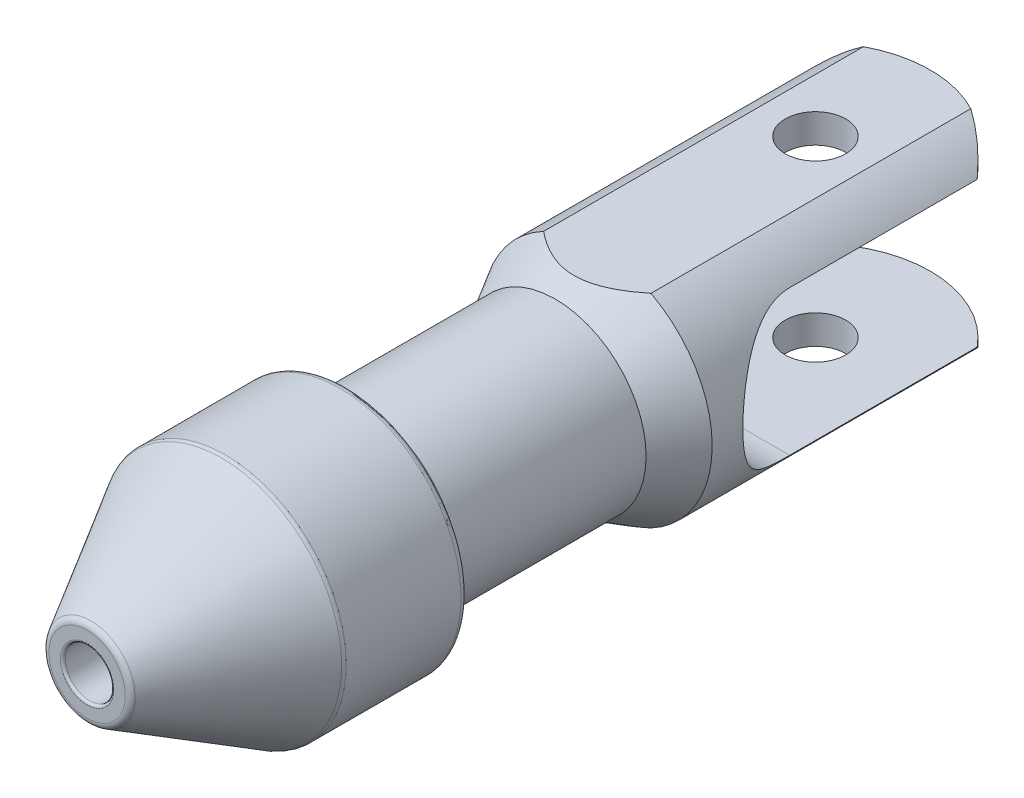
ISO-10303-21;
HEADER;
FILE_DESCRIPTION(('STEP AP214'),'2;1');
FILE_NAME('part.step','',(''),(''),'','','');
FILE_SCHEMA(('AUTOMOTIVE_DESIGN { 1 0 10303 214 1 1 1 1 }'));
ENDSEC;
DATA;
#1=APPLICATION_CONTEXT('core data for automotive mechanical design processes');
#2=APPLICATION_PROTOCOL_DEFINITION('international standard','automotive_design',2000,#1);
#3=PRODUCT_CONTEXT('',#1,'mechanical');
#4=PRODUCT('Part','Part','',(#3));
#5=PRODUCT_RELATED_PRODUCT_CATEGORY('part','',(#4));
#6=PRODUCT_DEFINITION_FORMATION('','',#4);
#7=PRODUCT_DEFINITION_CONTEXT('part definition',#1,'design');
#8=PRODUCT_DEFINITION('design','',#6,#7);
#9=PRODUCT_DEFINITION_SHAPE('','',#8);
#10=(LENGTH_UNIT() NAMED_UNIT(*) SI_UNIT(.MILLI.,.METRE.));
#11=(NAMED_UNIT(*) PLANE_ANGLE_UNIT() SI_UNIT($,.RADIAN.));
#12=(NAMED_UNIT(*) SI_UNIT($,.STERADIAN.) SOLID_ANGLE_UNIT());
#13=UNCERTAINTY_MEASURE_WITH_UNIT(LENGTH_MEASURE(1.E-05),#10,'distance_accuracy_value','');
#14=(GEOMETRIC_REPRESENTATION_CONTEXT(3) GLOBAL_UNCERTAINTY_ASSIGNED_CONTEXT((#13)) GLOBAL_UNIT_ASSIGNED_CONTEXT((#10,
#11,#12)) REPRESENTATION_CONTEXT('',''));
#15=CARTESIAN_POINT('',(0.,0.,0.));
#16=DIRECTION('',(0.,0.,1.));
#17=DIRECTION('',(1.,0.,0.));
#18=AXIS2_PLACEMENT_3D('',#15,#16,#17);
#19=CARTESIAN_POINT('',(0.,-27.75,53.7618675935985));
#20=DIRECTION('',(0.,0.,1.));
#21=DIRECTION('',(0.,-1.,0.));
#22=AXIS2_PLACEMENT_3D('',#19,#20,#21);
#23=PLANE('',#22);
#24=CARTESIAN_POINT('',(0.,0.,53.7618675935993));
#25=DIRECTION('',(0.,0.,-1.));
#26=DIRECTION('',(-1.,0.,0.));
#27=AXIS2_PLACEMENT_3D('',#24,#25,#26);
#28=CIRCLE('',#27,16.7480854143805);
#29=CARTESIAN_POINT('',(-16.7480854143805,0.,53.7618675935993));
#30=VERTEX_POINT('',#29);
#31=EDGE_CURVE('E19',#30,#30,#28,.F.);
#32=ORIENTED_EDGE('',*,*,#31,.T.);
#33=EDGE_LOOP('',(#32));
#34=FACE_BOUND('',#33,.T.);
#35=CARTESIAN_POINT('',(0.,0.,53.7618675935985));
#36=DIRECTION('',(0.,0.,-1.));
#37=DIRECTION('',(0.,1.,0.));
#38=AXIS2_PLACEMENT_3D('',#35,#36,#37);
#39=CIRCLE('',#38,27.75);
#40=CARTESIAN_POINT('',(0.,27.75,53.7618675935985));
#41=VERTEX_POINT('',#40);
#42=EDGE_CURVE('E240',#41,#41,#39,.T.);
#43=ORIENTED_EDGE('',*,*,#42,.T.);
#44=EDGE_LOOP('',(#43));
#45=FACE_BOUND('',#44,.T.);
#46=ADVANCED_FACE('F16',(#34,#45),#23,.F.);
#47=CARTESIAN_POINT('',(0.,0.,53.7618675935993));
#48=DIRECTION('',(0.,0.,-1.));
#49=DIRECTION('',(-1.,0.,0.));
#50=AXIS2_PLACEMENT_3D('',#47,#48,#49);
#51=CONICAL_SURFACE('',#50,16.7480854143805,0.0750491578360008);
#52=CARTESIAN_POINT('',(0.,0.,143.508529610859));
#53=DIRECTION('',(0.,0.,-1.));
#54=DIRECTION('',(0.,1.,0.));
#55=AXIS2_PLACEMENT_3D('',#52,#53,#54);
#56=CIRCLE('',#55,10.);
#57=CARTESIAN_POINT('',(0.,9.99999999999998,143.508529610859));
#58=VERTEX_POINT('',#57);
#59=EDGE_CURVE('E235',#58,#58,#56,.F.);
#60=ORIENTED_EDGE('',*,*,#59,.T.);
#61=EDGE_LOOP('',(#60));
#62=FACE_BOUND('',#61,.T.);
#63=ORIENTED_EDGE('',*,*,#31,.F.);
#64=EDGE_LOOP('',(#63));
#65=FACE_BOUND('',#64,.T.);
#66=ADVANCED_FACE('F425',(#62,#65),#51,.F.);
#67=CARTESIAN_POINT('',(0.,0.,47.7618675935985));
#68=DIRECTION('',(0.,0.,-1.));
#69=DIRECTION('',(0.,1.,0.));
#70=AXIS2_PLACEMENT_3D('',#67,#68,#69);
#71=CYLINDRICAL_SURFACE('',#70,27.75);
#72=ORIENTED_EDGE('',*,*,#42,.F.);
#73=EDGE_LOOP('',(#72));
#74=FACE_BOUND('',#73,.T.);
#75=CARTESIAN_POINT('',(0.,0.,41.7618675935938));
#76=DIRECTION('',(0.,0.,1.));
#77=DIRECTION('',(0.,-1.,0.));
#78=AXIS2_PLACEMENT_3D('',#75,#76,#77);
#79=CIRCLE('',#78,27.7500000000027);
#80=CARTESIAN_POINT('',(0.,-27.7500000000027,41.7618675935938));
#81=VERTEX_POINT('',#80);
#82=EDGE_CURVE('E227',#81,#81,#79,.F.);
#83=ORIENTED_EDGE('',*,*,#82,.T.);
#84=EDGE_LOOP('',(#83));
#85=FACE_BOUND('',#84,.T.);
#86=ADVANCED_FACE('F427',(#74,#85),#71,.F.);
#87=CARTESIAN_POINT('',(0.,0.,156.008529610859));
#88=DIRECTION('',(0.,0.,-1.));
#89=DIRECTION('',(0.,1.,0.));
#90=AXIS2_PLACEMENT_3D('',#87,#88,#89);
#91=CYLINDRICAL_SURFACE('',#90,10.);
#92=CARTESIAN_POINT('',(0.,0.,167.508529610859));
#93=DIRECTION('',(0.,0.,-1.));
#94=DIRECTION('',(-1.,0.,0.));
#95=AXIS2_PLACEMENT_3D('',#92,#93,#94);
#96=CIRCLE('',#95,10.);
#97=CARTESIAN_POINT('',(-10.,0.,167.508529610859));
#98=VERTEX_POINT('',#97);
#99=EDGE_CURVE('E208',#98,#98,#96,.T.);
#100=ORIENTED_EDGE('',*,*,#99,.F.);
#101=EDGE_LOOP('',(#100));
#102=FACE_BOUND('',#101,.T.);
#103=ORIENTED_EDGE('',*,*,#59,.F.);
#104=EDGE_LOOP('',(#103));
#105=FACE_BOUND('',#104,.T.);
#106=ADVANCED_FACE('F434',(#102,#105),#91,.F.);
#107=CARTESIAN_POINT('',(0.,0.,41.7618675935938));
#108=DIRECTION('',(0.,0.,1.));
#109=DIRECTION('',(1.,0.,0.));
#110=AXIS2_PLACEMENT_3D('',#107,#108,#109);
#111=CONICAL_SURFACE('',#110,27.7500000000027,1.0471975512);
#112=ORIENTED_EDGE('',*,*,#82,.F.);
#113=EDGE_LOOP('',(#112));
#114=FACE_BOUND('',#113,.T.);
#115=CARTESIAN_POINT('',(0.,0.,40.6799131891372));
#116=DIRECTION('',(0.,0.,1.));
#117=DIRECTION('',(1.,0.,0.));
#118=AXIS2_PLACEMENT_3D('',#115,#116,#117);
#119=CIRCLE('',#118,25.876);
#120=CARTESIAN_POINT('',(25.876,0.,40.6799131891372));
#121=VERTEX_POINT('',#120);
#122=EDGE_CURVE('E200',#121,#121,#119,.F.);
#123=ORIENTED_EDGE('',*,*,#122,.T.);
#124=EDGE_LOOP('',(#123));
#125=FACE_BOUND('',#124,.T.);
#126=ADVANCED_FACE('F218',(#114,#125),#111,.F.);
#127=CARTESIAN_POINT('',(0.,0.,167.508529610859));
#128=DIRECTION('',(0.,0.,-1.));
#129=DIRECTION('',(-1.,0.,0.));
#130=AXIS2_PLACEMENT_3D('',#127,#128,#129);
#131=TOROIDAL_SURFACE('',#130,11.,1.);
#132=CARTESIAN_POINT('',(0.,0.,168.508529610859));
#133=DIRECTION('',(0.,0.,1.));
#134=DIRECTION('',(0.,-1.,0.));
#135=AXIS2_PLACEMENT_3D('',#132,#133,#134);
#136=CIRCLE('',#135,11.);
#137=CARTESIAN_POINT('',(0.,-11.,168.508529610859));
#138=VERTEX_POINT('',#137);
#139=EDGE_CURVE('E163',#138,#138,#136,.F.);
#140=ORIENTED_EDGE('',*,*,#139,.F.);
#141=EDGE_LOOP('',(#140));
#142=FACE_BOUND('',#141,.T.);
#143=ORIENTED_EDGE('',*,*,#99,.T.);
#144=EDGE_LOOP('',(#143));
#145=FACE_BOUND('',#144,.T.);
#146=ADVANCED_FACE('F214',(#142,#145),#131,.T.);
#147=CARTESIAN_POINT('',(0.,0.,22.5));
#148=DIRECTION('',(0.,0.,1.));
#149=DIRECTION('',(1.,0.,0.));
#150=AXIS2_PLACEMENT_3D('',#147,#148,#149);
#151=CYLINDRICAL_SURFACE('',#150,25.876);
#152=CARTESIAN_POINT('',(0.,0.,13.6568778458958));
#153=DIRECTION('',(0.,0.,-1.));
#154=DIRECTION('',(0.,-1.,0.));
#155=AXIS2_PLACEMENT_3D('',#152,#153,#154);
#156=CIRCLE('',#155,25.8759999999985);
#157=CARTESIAN_POINT('',(0.,-25.8759999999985,13.6568778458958));
#158=VERTEX_POINT('',#157);
#159=EDGE_CURVE('E159',#158,#158,#156,.T.);
#160=ORIENTED_EDGE('',*,*,#159,.T.);
#161=EDGE_LOOP('',(#160));
#162=FACE_BOUND('',#161,.T.);
#163=ORIENTED_EDGE('',*,*,#122,.F.);
#164=EDGE_LOOP('',(#163));
#165=FACE_BOUND('',#164,.T.);
#166=ADVANCED_FACE('F184',(#162,#165),#151,.F.);
#167=CARTESIAN_POINT('',(0.,17.5,168.508529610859));
#168=DIRECTION('',(0.,0.,1.));
#169=DIRECTION('',(0.,-1.,0.));
#170=AXIS2_PLACEMENT_3D('',#167,#168,#169);
#171=PLANE('',#170);
#172=ORIENTED_EDGE('',*,*,#139,.T.);
#173=EDGE_LOOP('',(#172));
#174=FACE_BOUND('',#173,.T.);
#175=CARTESIAN_POINT('',(0.,0.,168.508529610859));
#176=DIRECTION('',(0.,0.,-1.));
#177=DIRECTION('',(0.,1.,0.));
#178=AXIS2_PLACEMENT_3D('',#175,#176,#177);
#179=CIRCLE('',#178,15.7679491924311);
#180=CARTESIAN_POINT('',(0.,15.7679491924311,168.508529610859));
#181=VERTEX_POINT('',#180);
#182=EDGE_CURVE('E162',#181,#181,#179,.T.);
#183=ORIENTED_EDGE('',*,*,#182,.F.);
#184=EDGE_LOOP('',(#183));
#185=FACE_BOUND('',#184,.T.);
#186=ADVANCED_FACE('F175',(#174,#185),#171,.T.);
#187=CARTESIAN_POINT('',(0.,0.,10.4110146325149));
#188=DIRECTION('',(0.,0.,-1.));
#189=DIRECTION('',(0.,1.,0.));
#190=AXIS2_PLACEMENT_3D('',#187,#188,#189);
#191=CONICAL_SURFACE('',#190,27.7500000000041,0.5235987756);
#192=CARTESIAN_POINT('',(0.,0.,10.4110146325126));
#193=DIRECTION('',(0.,0.,-1.));
#194=DIRECTION('',(0.,1.,0.));
#195=AXIS2_PLACEMENT_3D('',#192,#193,#194);
#196=CIRCLE('',#195,27.75);
#197=CARTESIAN_POINT('',(0.,27.75,10.4110146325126));
#198=VERTEX_POINT('',#197);
#199=EDGE_CURVE('E777',#198,#198,#196,.T.);
#200=ORIENTED_EDGE('',*,*,#199,.T.);
#201=EDGE_LOOP('',(#200));
#202=FACE_BOUND('',#201,.T.);
#203=ORIENTED_EDGE('',*,*,#159,.F.);
#204=EDGE_LOOP('',(#203));
#205=FACE_BOUND('',#204,.T.);
#206=ADVANCED_FACE('F150',(#202,#205),#191,.F.);
#207=CARTESIAN_POINT('',(0.,0.,165.508529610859));
#208=DIRECTION('',(0.,0.,-1.));
#209=DIRECTION('',(-1.,0.,0.));
#210=AXIS2_PLACEMENT_3D('',#207,#208,#209);
#211=TOROIDAL_SURFACE('',#210,15.7679491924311,3.);
#212=CARTESIAN_POINT('',(0.,0.,167.008529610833));
#213=DIRECTION('',(0.,0.,-1.));
#214=DIRECTION('',(0.,1.,0.));
#215=AXIS2_PLACEMENT_3D('',#212,#213,#214);
#216=CIRCLE('',#215,18.3660254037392);
#217=CARTESIAN_POINT('',(0.,18.3660254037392,167.008529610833));
#218=VERTEX_POINT('',#217);
#219=EDGE_CURVE('E417',#218,#218,#216,.T.);
#220=ORIENTED_EDGE('',*,*,#219,.F.);
#221=EDGE_LOOP('',(#220));
#222=FACE_BOUND('',#221,.T.);
#223=ORIENTED_EDGE('',*,*,#182,.T.);
#224=EDGE_LOOP('',(#223));
#225=FACE_BOUND('',#224,.T.);
#226=ADVANCED_FACE('F144',(#222,#225),#211,.T.);
#227=CARTESIAN_POINT('',(0.,0.,-22.987907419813));
#228=DIRECTION('',(0.,0.,-1.));
#229=DIRECTION('',(0.,1.,0.));
#230=AXIS2_PLACEMENT_3D('',#227,#228,#229);
#231=CYLINDRICAL_SURFACE('',#230,27.75);
#232=ORIENTED_EDGE('',*,*,#199,.F.);
#233=EDGE_LOOP('',(#232));
#234=FACE_BOUND('',#233,.T.);
#235=CARTESIAN_POINT('',(0.,0.,-55.));
#236=DIRECTION('',(0.,0.,-1.));
#237=DIRECTION('',(0.,1.,0.));
#238=AXIS2_PLACEMENT_3D('',#235,#236,#237);
#239=CIRCLE('',#238,27.75);
#240=CARTESIAN_POINT('',(0.,27.75,-55.));
#241=VERTEX_POINT('',#240);
#242=EDGE_CURVE('E415',#241,#241,#239,.T.);
#243=ORIENTED_EDGE('',*,*,#242,.T.);
#244=EDGE_LOOP('',(#243));
#245=FACE_BOUND('',#244,.T.);
#246=ADVANCED_FACE('F140',(#234,#245),#231,.F.);
#247=CARTESIAN_POINT('',(0.,0.,112.913030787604));
#248=DIRECTION('',(0.,0.,-1.));
#249=DIRECTION('',(-1.,0.,0.));
#250=AXIS2_PLACEMENT_3D('',#247,#248,#249);
#251=CONICAL_SURFACE('',#250,49.5980762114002,0.5235987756);
#252=CARTESIAN_POINT('',(0.,0.,112.913030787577));
#253=DIRECTION('',(0.,0.,-1.));
#254=DIRECTION('',(-1.,0.,0.));
#255=AXIS2_PLACEMENT_3D('',#252,#253,#254);
#256=CIRCLE('',#255,49.5980762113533);
#257=CARTESIAN_POINT('',(-49.5980762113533,0.,112.913030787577));
#258=VERTEX_POINT('',#257);
#259=EDGE_CURVE('E127',#258,#258,#256,.T.);
#260=ORIENTED_EDGE('',*,*,#259,.F.);
#261=EDGE_LOOP('',(#260));
#262=FACE_BOUND('',#261,.T.);
#263=ORIENTED_EDGE('',*,*,#219,.T.);
#264=EDGE_LOOP('',(#263));
#265=FACE_BOUND('',#264,.T.);
#266=ADVANCED_FACE('F137',(#262,#265),#251,.T.);
#267=CARTESIAN_POINT('',(0.,0.,-55.));
#268=DIRECTION('',(0.,0.,1.));
#269=DIRECTION('',(1.,0.,0.));
#270=AXIS2_PLACEMENT_3D('',#267,#268,#269);
#271=PLANE('',#270);
#272=CARTESIAN_POINT('',(0.,0.,-55.));
#273=DIRECTION('',(0.,0.,-1.));
#274=DIRECTION('',(0.,1.,0.));
#275=AXIS2_PLACEMENT_3D('',#272,#273,#274);
#276=CIRCLE('',#275,30.0000000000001);
#277=CARTESIAN_POINT('',(-30.0000000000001,0.,-55.));
#278=VERTEX_POINT('',#277);
#279=CARTESIAN_POINT('',(30.0000000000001,0.,-55.));
#280=VERTEX_POINT('',#279);
#281=EDGE_CURVE('E92',#278,#280,#276,.T.);
#282=ORIENTED_EDGE('',*,*,#281,.T.);
#283=CARTESIAN_POINT('',(0.,0.,-55.));
#284=DIRECTION('',(0.,0.,-1.));
#285=DIRECTION('',(0.,1.,0.));
#286=AXIS2_PLACEMENT_3D('',#283,#284,#285);
#287=CIRCLE('',#286,30.0000000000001);
#288=EDGE_CURVE('E413',#280,#278,#287,.T.);
#289=ORIENTED_EDGE('',*,*,#288,.T.);
#290=EDGE_LOOP('',(#282,#289));
#291=FACE_BOUND('',#290,.T.);
#292=ORIENTED_EDGE('',*,*,#242,.F.);
#293=EDGE_LOOP('',(#292));
#294=FACE_BOUND('',#293,.T.);
#295=ADVANCED_FACE('F132',(#291,#294),#271,.F.);
#296=CARTESIAN_POINT('',(0.,0.,111.413030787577));
#297=DIRECTION('',(0.,0.,-1.));
#298=DIRECTION('',(-1.,0.,0.));
#299=AXIS2_PLACEMENT_3D('',#296,#297,#298);
#300=TOROIDAL_SURFACE('',#299,47.,3.);
#301=CARTESIAN_POINT('',(0.,0.,111.413030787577));
#302=DIRECTION('',(0.,0.,-1.));
#303=DIRECTION('',(0.,1.,0.));
#304=AXIS2_PLACEMENT_3D('',#301,#302,#303);
#305=CIRCLE('',#304,50.);
#306=CARTESIAN_POINT('',(0.,50.,111.413030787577));
#307=VERTEX_POINT('',#306);
#308=EDGE_CURVE('E111',#307,#307,#305,.T.);
#309=ORIENTED_EDGE('',*,*,#308,.F.);
#310=EDGE_LOOP('',(#309));
#311=FACE_BOUND('',#310,.T.);
#312=ORIENTED_EDGE('',*,*,#259,.T.);
#313=EDGE_LOOP('',(#312));
#314=FACE_BOUND('',#313,.T.);
#315=ADVANCED_FACE('F104',(#311,#314),#300,.T.);
#316=CARTESIAN_POINT('',(-10.,-32.8999999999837,-112.5));
#317=DIRECTION('',(0.,-1.,0.));
#318=DIRECTION('',(0.,0.,-1.));
#319=AXIS2_PLACEMENT_3D('',#316,#317,#318);
#320=CONICAL_SURFACE('',#319,2.45850000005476,1.02974425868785);
#321=CARTESIAN_POINT('',(-9.99999999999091,-31.4227841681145,-112.5));
#322=VERTEX_POINT('',#321);
#323=VERTEX_LOOP('',#322);
#324=FACE_BOUND('',#323,.T.);
#325=CARTESIAN_POINT('',(-10.,-32.8999999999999,-112.5));
#326=DIRECTION('',(0.,-1.,0.));
#327=DIRECTION('',(0.,0.,-1.));
#328=AXIS2_PLACEMENT_3D('',#325,#326,#327);
#329=CIRCLE('',#328,2.4585);
#330=CARTESIAN_POINT('',(-10.,-32.8999999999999,-114.9585));
#331=VERTEX_POINT('',#330);
#332=EDGE_CURVE('E108',#331,#331,#329,.T.);
#333=ORIENTED_EDGE('',*,*,#332,.T.);
#334=EDGE_LOOP('',(#333));
#335=FACE_BOUND('',#334,.T.);
#336=ADVANCED_FACE('F100',(#324,#335),#320,.F.);
#337=CARTESIAN_POINT('',(10.,-32.8999999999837,-112.5));
#338=DIRECTION('',(0.,-1.,0.));
#339=DIRECTION('',(0.,0.,-1.));
#340=AXIS2_PLACEMENT_3D('',#337,#338,#339);
#341=CONICAL_SURFACE('',#340,2.45849999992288,1.02974425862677);
#342=CARTESIAN_POINT('',(9.99999999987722,-31.4227841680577,-112.5));
#343=VERTEX_POINT('',#342);
#344=VERTEX_LOOP('',#343);
#345=FACE_BOUND('',#344,.T.);
#346=CARTESIAN_POINT('',(10.,-32.8999999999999,-112.5));
#347=DIRECTION('',(0.,-1.,0.));
#348=DIRECTION('',(0.,0.,-1.));
#349=AXIS2_PLACEMENT_3D('',#346,#347,#348);
#350=CIRCLE('',#349,2.4585);
#351=CARTESIAN_POINT('',(10.,-32.8999999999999,-114.9585));
#352=VERTEX_POINT('',#351);
#353=EDGE_CURVE('E110',#352,#352,#350,.T.);
#354=ORIENTED_EDGE('',*,*,#353,.T.);
#355=EDGE_LOOP('',(#354));
#356=FACE_BOUND('',#355,.T.);
#357=ADVANCED_FACE('F103',(#345,#356),#341,.F.);
#358=CARTESIAN_POINT('',(0.,0.,-120.));
#359=DIRECTION('',(0.,0.,-1.));
#360=DIRECTION('',(0.,1.,0.));
#361=AXIS2_PLACEMENT_3D('',#358,#359,#360);
#362=CYLINDRICAL_SURFACE('',#361,30.0000000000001);
#363=CARTESIAN_POINT('',(0.,0.,-85.));
#364=DIRECTION('',(-0.707106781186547,0.,-0.707106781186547));
#365=DIRECTION('',(0.707106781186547,0.,-0.707106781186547));
#366=AXIS2_PLACEMENT_3D('',#363,#364,#365);
#367=ELLIPSE('',#366,42.4264068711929,30.);
#368=CARTESIAN_POINT('',(0.,-30.,-85.));
#369=VERTEX_POINT('',#368);
#370=EDGE_CURVE('E381',#369,#278,#367,.T.);
#371=ORIENTED_EDGE('',*,*,#370,.T.);
#372=ORIENTED_EDGE('',*,*,#288,.F.);
#373=CARTESIAN_POINT('',(0.,0.,-85.));
#374=DIRECTION('',(0.707106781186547,0.,-0.707106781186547));
#375=DIRECTION('',(-0.707106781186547,0.,-0.707106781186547));
#376=AXIS2_PLACEMENT_3D('',#373,#374,#375);
#377=ELLIPSE('',#376,42.4264068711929,30.);
#378=EDGE_CURVE('E370',#280,#369,#377,.T.);
#379=ORIENTED_EDGE('',*,*,#378,.T.);
#380=EDGE_LOOP('',(#371,#372,#379));
#381=FACE_BOUND('',#380,.T.);
#382=ADVANCED_FACE('F635',(#381),#362,.F.);
#383=CARTESIAN_POINT('',(0.,0.,-120.));
#384=DIRECTION('',(0.,0.,-1.));
#385=DIRECTION('',(0.,1.,0.));
#386=AXIS2_PLACEMENT_3D('',#383,#384,#385);
#387=CYLINDRICAL_SURFACE('',#386,30.0000000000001);
#388=ORIENTED_EDGE('',*,*,#281,.F.);
#389=CARTESIAN_POINT('',(0.,0.,-85.));
#390=DIRECTION('',(-0.707106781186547,0.,-0.707106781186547));
#391=DIRECTION('',(0.707106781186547,0.,-0.707106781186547));
#392=AXIS2_PLACEMENT_3D('',#389,#390,#391);
#393=ELLIPSE('',#392,42.4264068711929,30.);
#394=CARTESIAN_POINT('',(0.,30.,-85.));
#395=VERTEX_POINT('',#394);
#396=EDGE_CURVE('E366',#278,#395,#393,.T.);
#397=ORIENTED_EDGE('',*,*,#396,.T.);
#398=CARTESIAN_POINT('',(0.,0.,-85.));
#399=DIRECTION('',(0.707106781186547,0.,-0.707106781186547));
#400=DIRECTION('',(-0.707106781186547,0.,-0.707106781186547));
#401=AXIS2_PLACEMENT_3D('',#398,#399,#400);
#402=ELLIPSE('',#401,42.4264068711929,30.);
#403=EDGE_CURVE('E114',#395,#280,#402,.T.);
#404=ORIENTED_EDGE('',*,*,#403,.T.);
#405=EDGE_LOOP('',(#388,#397,#404));
#406=FACE_BOUND('',#405,.T.);
#407=ADVANCED_FACE('F403',(#406),#387,.F.);
#408=CARTESIAN_POINT('',(0.,0.,87.2168783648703));
#409=DIRECTION('',(0.,0.,-1.));
#410=DIRECTION('',(0.,1.,0.));
#411=AXIS2_PLACEMENT_3D('',#408,#409,#410);
#412=CYLINDRICAL_SURFACE('',#411,50.);
#413=CARTESIAN_POINT('',(0.,0.,63.9489291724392));
#414=DIRECTION('',(0.,0.,-1.));
#415=DIRECTION('',(-1.,0.,0.));
#416=AXIS2_PLACEMENT_3D('',#413,#414,#415);
#417=CIRCLE('',#416,50.);
#418=CARTESIAN_POINT('',(-50.,0.,63.9489291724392));
#419=VERTEX_POINT('',#418);
#420=EDGE_CURVE('E353',#419,#419,#417,.T.);
#421=ORIENTED_EDGE('',*,*,#420,.F.);
#422=EDGE_LOOP('',(#421));
#423=FACE_BOUND('',#422,.T.);
#424=ORIENTED_EDGE('',*,*,#308,.T.);
#425=EDGE_LOOP('',(#424));
#426=FACE_BOUND('',#425,.T.);
#427=ADVANCED_FACE('F619',(#423,#426),#412,.T.);
#428=CARTESIAN_POINT('',(-10.,-37.4499999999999,-112.5));
#429=DIRECTION('',(0.,-1.,0.));
#430=DIRECTION('',(0.,0.,-1.));
#431=AXIS2_PLACEMENT_3D('',#428,#429,#430);
#432=CYLINDRICAL_SURFACE('',#431,2.4585);
#433=ORIENTED_EDGE('',*,*,#332,.F.);
#434=EDGE_LOOP('',(#433));
#435=FACE_BOUND('',#434,.T.);
#436=CARTESIAN_POINT('',(-10.,-41.9999999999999,-112.5));
#437=DIRECTION('',(0.,-1.,0.));
#438=DIRECTION('',(0.,0.,-1.));
#439=AXIS2_PLACEMENT_3D('',#436,#437,#438);
#440=CIRCLE('',#439,2.4585);
#441=CARTESIAN_POINT('',(-10.,-41.9999999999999,-114.9585));
#442=VERTEX_POINT('',#441);
#443=EDGE_CURVE('E356',#442,#442,#440,.T.);
#444=ORIENTED_EDGE('',*,*,#443,.T.);
#445=EDGE_LOOP('',(#444));
#446=FACE_BOUND('',#445,.T.);
#447=ADVANCED_FACE('F611',(#435,#446),#432,.F.);
#448=CARTESIAN_POINT('',(10.,-37.4499999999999,-112.5));
#449=DIRECTION('',(0.,-1.,0.));
#450=DIRECTION('',(0.,0.,-1.));
#451=AXIS2_PLACEMENT_3D('',#448,#449,#450);
#452=CYLINDRICAL_SURFACE('',#451,2.4585);
#453=ORIENTED_EDGE('',*,*,#353,.F.);
#454=EDGE_LOOP('',(#453));
#455=FACE_BOUND('',#454,.T.);
#456=CARTESIAN_POINT('',(10.,-41.9999999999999,-112.5));
#457=DIRECTION('',(0.,-1.,0.));
#458=DIRECTION('',(0.,0.,-1.));
#459=AXIS2_PLACEMENT_3D('',#456,#457,#458);
#460=CIRCLE('',#459,2.4585);
#461=CARTESIAN_POINT('',(10.,-41.9999999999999,-114.9585));
#462=VERTEX_POINT('',#461);
#463=EDGE_CURVE('E487',#462,#462,#460,.T.);
#464=ORIENTED_EDGE('',*,*,#463,.T.);
#465=EDGE_LOOP('',(#464));
#466=FACE_BOUND('',#465,.T.);
#467=ADVANCED_FACE('F604',(#455,#466),#452,.F.);
#468=CARTESIAN_POINT('',(0.,30.0000000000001,-132.5));
#469=DIRECTION('',(0.,-1.,0.));
#470=DIRECTION('',(0.,0.,-1.));
#471=AXIS2_PLACEMENT_3D('',#468,#469,#470);
#472=CYLINDRICAL_SURFACE('',#471,12.5);
#473=CARTESIAN_POINT('',(0.,-29.9999999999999,-132.5));
#474=DIRECTION('',(0.,-1.,0.));
#475=DIRECTION('',(0.,0.,-1.));
#476=AXIS2_PLACEMENT_3D('',#473,#474,#475);
#477=CIRCLE('',#476,12.5);
#478=CARTESIAN_POINT('',(0.,-29.9999999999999,-145.));
#479=VERTEX_POINT('',#478);
#480=EDGE_CURVE('E362',#479,#479,#477,.F.);
#481=ORIENTED_EDGE('',*,*,#480,.T.);
#482=EDGE_LOOP('',(#481));
#483=FACE_BOUND('',#482,.T.);
#484=CARTESIAN_POINT('',(0.,-41.9999999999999,-132.5));
#485=DIRECTION('',(0.,-1.,0.));
#486=DIRECTION('',(0.,0.,-1.));
#487=AXIS2_PLACEMENT_3D('',#484,#485,#486);
#488=CIRCLE('',#487,12.5);
#489=CARTESIAN_POINT('',(0.,-41.9999999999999,-145.));
#490=VERTEX_POINT('',#489);
#491=EDGE_CURVE('E481',#490,#490,#488,.T.);
#492=ORIENTED_EDGE('',*,*,#491,.T.);
#493=EDGE_LOOP('',(#492));
#494=FACE_BOUND('',#493,.T.);
#495=ADVANCED_FACE('F317',(#483,#494),#472,.F.);
#496=CARTESIAN_POINT('',(0.,0.,-85.));
#497=DIRECTION('',(1.,0.,0.));
#498=DIRECTION('',(0.,0.,-1.));
#499=AXIS2_PLACEMENT_3D('',#496,#497,#498);
#500=CYLINDRICAL_SURFACE('',#499,30.);
#501=DIRECTION('',(1.,0.,0.));
#502=VECTOR('',#501,1.);
#503=CARTESIAN_POINT('',(0.,-30.,-85.));
#504=LINE('',#503,#502);
#505=CARTESIAN_POINT('',(36.8272996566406,-30.,-85.));
#506=VERTEX_POINT('',#505);
#507=EDGE_CURVE('E363',#506,#369,#504,.F.);
#508=ORIENTED_EDGE('',*,*,#507,.T.);
#509=ORIENTED_EDGE('',*,*,#378,.F.);
#510=ORIENTED_EDGE('',*,*,#403,.F.);
#511=DIRECTION('',(1.,0.,0.));
#512=VECTOR('',#511,1.);
#513=CARTESIAN_POINT('',(0.,30.,-85.));
#514=LINE('',#513,#512);
#515=CARTESIAN_POINT('',(36.8272996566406,30.,-85.));
#516=VERTEX_POINT('',#515);
#517=EDGE_CURVE('E367',#395,#516,#514,.T.);
#518=ORIENTED_EDGE('',*,*,#517,.T.);
#519=CARTESIAN_POINT('',(36.8272996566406,-30.,-85.));
#520=CARTESIAN_POINT('',(36.8272760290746,-30.0000119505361,-84.6255440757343));
#521=CARTESIAN_POINT('',(36.8330102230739,-29.9929894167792,-84.2510978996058));
#522=CARTESIAN_POINT('',(36.8558193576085,-29.9649658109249,-83.5031049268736));
#523=CARTESIAN_POINT('',(36.872893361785,-29.9439658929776,-83.1295580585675));
#524=CARTESIAN_POINT('',(36.9181821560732,-29.8881089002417,-82.3845946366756));
#525=CARTESIAN_POINT('',(36.9463845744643,-29.8532672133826,-82.0131761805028));
#526=CARTESIAN_POINT('',(37.0135841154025,-29.7699080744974,-81.2728854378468));
#527=CARTESIAN_POINT('',(37.0525813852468,-29.7213904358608,-80.9040131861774));
#528=CARTESIAN_POINT('',(37.18435762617,-29.5566159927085,-79.8088717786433));
#529=CARTESIAN_POINT('',(37.2923499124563,-29.4206191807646,-79.0872596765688));
#530=CARTESIAN_POINT('',(37.5446865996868,-29.0979075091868,-77.6620032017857));
#531=CARTESIAN_POINT('',(37.6890396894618,-28.9111805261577,-76.9583631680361));
#532=CARTESIAN_POINT('',(38.0080414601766,-28.4904911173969,-75.576010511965));
#533=CARTESIAN_POINT('',(38.1825543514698,-28.2567396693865,-74.8972020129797));
#534=CARTESIAN_POINT('',(38.5566990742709,-27.7440369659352,-73.5641579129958));
#535=CARTESIAN_POINT('',(38.7563299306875,-27.4650874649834,-72.909921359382));
#536=CARTESIAN_POINT('',(39.1756549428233,-26.86359496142,-71.6264915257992));
#537=CARTESIAN_POINT('',(39.3953955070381,-26.540950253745,-70.9973612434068));
#538=CARTESIAN_POINT('',(39.8492045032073,-25.8545969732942,-69.7672726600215));
#539=CARTESIAN_POINT('',(40.083274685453,-25.4908833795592,-69.1663178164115));
#540=CARTESIAN_POINT('',(40.593236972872,-24.6718939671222,-67.9140090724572));
#541=CARTESIAN_POINT('',(40.8704821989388,-24.2108947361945,-67.2669435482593));
#542=CARTESIAN_POINT('',(41.4300917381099,-23.2402962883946,-66.012701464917));
#543=CARTESIAN_POINT('',(41.7124563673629,-22.7306940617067,-65.405527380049));
#544=CARTESIAN_POINT('',(42.2760021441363,-21.6645628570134,-64.2328427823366));
#545=CARTESIAN_POINT('',(42.5571828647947,-21.1080182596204,-63.667346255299));
#546=CARTESIAN_POINT('',(43.1122290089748,-19.9498904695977,-62.5805323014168));
#547=CARTESIAN_POINT('',(43.3860940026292,-19.3483046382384,-62.0592174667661));
#548=CARTESIAN_POINT('',(43.9540690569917,-18.0241854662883,-61.0013871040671));
#549=CARTESIAN_POINT('',(44.2464467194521,-17.2959236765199,-60.4710785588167));
#550=CARTESIAN_POINT('',(44.8067020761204,-15.7878592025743,-59.4743181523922));
#551=CARTESIAN_POINT('',(45.0745772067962,-15.0080511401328,-59.0078729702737));
#552=CARTESIAN_POINT('',(45.5779973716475,-13.401643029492,-58.1443335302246));
#553=CARTESIAN_POINT('',(45.8135647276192,-12.5750758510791,-57.7471913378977));
#554=CARTESIAN_POINT('',(46.2453654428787,-10.8802727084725,-57.0273921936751));
#555=CARTESIAN_POINT('',(46.441606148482,-10.0120445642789,-56.7047213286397));
#556=CARTESIAN_POINT('',(46.7704170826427,-8.33263759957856,-56.1683863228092));
#557=CARTESIAN_POINT('',(46.9074704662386,-7.52483065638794,-55.9469048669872));
#558=CARTESIAN_POINT('',(47.1409184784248,-5.88786992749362,-55.5714786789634));
#559=CARTESIAN_POINT('',(47.2373156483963,-5.05871747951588,-55.4175297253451));
#560=CARTESIAN_POINT('',(47.3864937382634,-3.3872695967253,-55.1799004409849));
#561=CARTESIAN_POINT('',(47.4393139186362,-2.54498669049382,-55.0961568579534));
#562=CARTESIAN_POINT('',(47.4998329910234,-0.854775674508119,-55.0002404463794));
#563=CARTESIAN_POINT('',(47.5075372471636,-0.00684824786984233,-54.988059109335));
#564=CARTESIAN_POINT('',(47.479672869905,1.56993735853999,-55.032193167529));
#565=CARTESIAN_POINT('',(47.4498939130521,2.2991770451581,-55.0793438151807));
#566=CARTESIAN_POINT('',(47.3573098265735,3.75013027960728,-55.2263861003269));
#567=CARTESIAN_POINT('',(47.2945084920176,4.47184468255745,-55.326271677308));
#568=CARTESIAN_POINT('',(47.1373058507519,5.90276085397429,-55.5774715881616));
#569=CARTESIAN_POINT('',(47.0429031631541,6.61196207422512,-55.7287881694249));
#570=CARTESIAN_POINT('',(46.8245669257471,8.01329208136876,-56.0809897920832));
#571=CARTESIAN_POINT('',(46.7006321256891,8.70542014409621,-56.281876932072));
#572=CARTESIAN_POINT('',(46.4256067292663,10.0696600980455,-56.7313143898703));
#573=CARTESIAN_POINT('',(46.2744743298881,10.7417392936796,-56.9799381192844));
#574=CARTESIAN_POINT('',(45.9481729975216,12.0614034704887,-57.5221639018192));
#575=CARTESIAN_POINT('',(45.7730043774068,12.7089887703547,-57.8157653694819));
#576=CARTESIAN_POINT('',(45.4018810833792,13.9769674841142,-58.4454242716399));
#577=CARTESIAN_POINT('',(45.2059257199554,14.5973599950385,-58.7814831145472));
#578=CARTESIAN_POINT('',(44.7966732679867,15.8087606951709,-59.4935922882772));
#579=CARTESIAN_POINT('',(44.5833750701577,16.3997670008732,-59.8696451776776));
#580=CARTESIAN_POINT('',(44.1153654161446,17.622863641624,-60.7090206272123));
#581=CARTESIAN_POINT('',(43.8588159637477,18.2508026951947,-61.1773726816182));
#582=CARTESIAN_POINT('',(43.3335283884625,19.4651764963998,-62.1588842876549));
#583=CARTESIAN_POINT('',(43.0647894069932,20.0516083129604,-62.6720469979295));
#584=CARTESIAN_POINT('',(42.5200922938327,21.1822130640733,-63.7415792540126));
#585=CARTESIAN_POINT('',(42.2441223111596,21.7263099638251,-64.2980231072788));
#586=CARTESIAN_POINT('',(41.6911310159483,22.7694566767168,-65.4511787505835));
#587=CARTESIAN_POINT('',(41.414109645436,23.2685039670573,-66.0478927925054));
#588=CARTESIAN_POINT('',(40.8278053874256,24.2843395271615,-67.3633354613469));
#589=CARTESIAN_POINT('',(40.5192422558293,24.794355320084,-68.0876365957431));
#590=CARTESIAN_POINT('',(39.918063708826,25.7510679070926,-69.5834260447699));
#591=CARTESIAN_POINT('',(39.6254509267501,26.1977542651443,-70.3549221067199));
#592=CARTESIAN_POINT('',(39.0676386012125,27.0225206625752,-71.9394404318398));
#593=CARTESIAN_POINT('',(38.8023440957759,27.4008420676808,-72.7523030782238));
#594=CARTESIAN_POINT('',(38.3091114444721,28.0863044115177,-74.4184048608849));
#595=CARTESIAN_POINT('',(38.0811622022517,28.3934665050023,-75.2716319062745));
#596=CARTESIAN_POINT('',(37.7134780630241,28.8793612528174,-76.8438952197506));
#597=CARTESIAN_POINT('',(37.5652087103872,29.0714499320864,-77.5568296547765));
#598=CARTESIAN_POINT('',(37.3058986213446,29.4034787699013,-79.0013433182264));
#599=CARTESIAN_POINT('',(37.1948430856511,29.5434396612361,-79.7329150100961));
#600=CARTESIAN_POINT('',(37.0592661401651,29.713059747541,-80.8435202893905));
#601=CARTESIAN_POINT('',(37.0191283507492,29.7630163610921,-81.2177016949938));
#602=CARTESIAN_POINT('',(36.9499517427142,29.8488548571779,-81.9687228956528));
#603=CARTESIAN_POINT('',(36.9209127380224,29.8847369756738,-82.345562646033));
#604=CARTESIAN_POINT('',(36.8742699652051,29.9422720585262,-83.101527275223));
#605=CARTESIAN_POINT('',(36.8566812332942,29.9639063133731,-83.4806545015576));
#606=CARTESIAN_POINT('',(36.8331830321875,29.992777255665,-84.2398509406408));
#607=CARTESIAN_POINT('',(36.8272746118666,30.0000126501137,-84.6199202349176));
#608=CARTESIAN_POINT('',(36.8272996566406,30.,-85.));
#609=B_SPLINE_CURVE_WITH_KNOTS('',3,(#519,#520,#521,#522,#523,#524,#525,#526,#527,#528,#529,
#530,#531,#532,#533,#534,#535,#536,#537,#538,#539,#540,#541,#542,#543,#544,#545,#546,#547,#548,
#549,#550,#551,#552,#553,#554,#555,#556,#557,#558,#559,#560,#561,#562,#563,#564,#565,#566,#567,
#568,#569,#570,#571,#572,#573,#574,#575,#576,#577,#578,#579,#580,#581,#582,#583,#584,#585,#586,
#587,#588,#589,#590,#591,#592,#593,#594,#595,#596,#597,#598,#599,#600,#601,#602,#603,#604,#605,
#606,#607,#608),.UNSPECIFIED.,.F.,.F.,(4,2,2,2,2,2,2,2,2,2,2,2,2,2,2,2,2,2,2,2,2,2,2,2,2,2,2,2,
2,2,2,2,2,2,2,2,2,2,2,2,2,2,2,2,4),(0.,1.12324121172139,2.24638968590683,3.36829303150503,
4.49021168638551,6.71357456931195,8.93746925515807,11.1516003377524,13.365645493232,
15.5849355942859,17.8044973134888,20.3264563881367,22.8485717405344,25.3715296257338,
27.8946354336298,30.7322849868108,33.5702310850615,36.4062064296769,39.2416515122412,
41.7841880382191,44.3265656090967,46.8666501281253,49.4064326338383,51.5979013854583,
53.7891183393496,55.9804310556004,58.1718365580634,60.36663949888,62.5614138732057,
64.7562610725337,66.9512487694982,69.4216834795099,71.8922924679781,74.3672409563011,
76.8423279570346,79.6530786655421,82.4642920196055,85.2653776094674,88.0656294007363,
90.3223083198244,92.5780887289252,93.7166198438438,94.855131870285,95.9951359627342,
97.1352424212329),.UNSPECIFIED.);
#610=EDGE_CURVE('E321',#506,#516,#609,.T.);
#611=ORIENTED_EDGE('',*,*,#610,.F.);
#612=EDGE_LOOP('',(#508,#509,#510,#518,#611));
#613=FACE_BOUND('',#612,.T.);
#614=ADVANCED_FACE('F312',(#613),#500,.F.);
#615=CARTESIAN_POINT('',(0.,30.0000000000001,-132.5));
#616=DIRECTION('',(0.,-1.,0.));
#617=DIRECTION('',(0.,0.,-1.));
#618=AXIS2_PLACEMENT_3D('',#615,#616,#617);
#619=CYLINDRICAL_SURFACE('',#618,12.5);
#620=CARTESIAN_POINT('',(0.,30.0000000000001,-132.5));
#621=DIRECTION('',(0.,-1.,0.));
#622=DIRECTION('',(0.,0.,-1.));
#623=AXIS2_PLACEMENT_3D('',#620,#621,#622);
#624=CIRCLE('',#623,12.5);
#625=CARTESIAN_POINT('',(0.,30.0000000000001,-145.));
#626=VERTEX_POINT('',#625);
#627=EDGE_CURVE('E388',#626,#626,#624,.T.);
#628=ORIENTED_EDGE('',*,*,#627,.T.);
#629=EDGE_LOOP('',(#628));
#630=FACE_BOUND('',#629,.T.);
#631=CARTESIAN_POINT('',(0.,42.0000000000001,-132.5));
#632=DIRECTION('',(0.,-1.,0.));
#633=DIRECTION('',(0.,0.,-1.));
#634=AXIS2_PLACEMENT_3D('',#631,#632,#633);
#635=CIRCLE('',#634,12.5);
#636=CARTESIAN_POINT('',(0.,42.0000000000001,-145.));
#637=VERTEX_POINT('',#636);
#638=EDGE_CURVE('E470',#637,#637,#635,.F.);
#639=ORIENTED_EDGE('',*,*,#638,.T.);
#640=EDGE_LOOP('',(#639));
#641=FACE_BOUND('',#640,.T.);
#642=ADVANCED_FACE('F308',(#630,#641),#619,.F.);
#643=CARTESIAN_POINT('',(0.,0.,-132.5));
#644=DIRECTION('',(0.,1.,0.));
#645=DIRECTION('',(0.,0.,1.));
#646=AXIS2_PLACEMENT_3D('',#643,#644,#645);
#647=CYLINDRICAL_SURFACE('',#646,47.5);
#648=CARTESIAN_POINT('',(0.,30.,-132.5));
#649=DIRECTION('',(0.,1.,0.));
#650=DIRECTION('',(0.,0.,1.));
#651=AXIS2_PLACEMENT_3D('',#648,#649,#650);
#652=CIRCLE('',#651,47.5);
#653=CARTESIAN_POINT('',(36.8272996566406,30.,-162.5));
#654=VERTEX_POINT('',#653);
#655=CARTESIAN_POINT('',(-36.8272996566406,30.,-162.5));
#656=VERTEX_POINT('',#655);
#657=EDGE_CURVE('E369',#654,#656,#652,.T.);
#658=ORIENTED_EDGE('',*,*,#657,.T.);
#659=CARTESIAN_POINT('',(0.,0.,-132.5));
#660=DIRECTION('',(0.,-0.707106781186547,-0.707106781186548));
#661=DIRECTION('',(0.,0.707106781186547,-0.707106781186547));
#662=AXIS2_PLACEMENT_3D('',#659,#660,#661);
#663=ELLIPSE('',#662,67.175144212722,47.5);
#664=CARTESIAN_POINT('',(-22.1867077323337,42.,-174.5));
#665=VERTEX_POINT('',#664);
#666=EDGE_CURVE('E291',#665,#656,#663,.F.);
#667=ORIENTED_EDGE('',*,*,#666,.F.);
#668=CARTESIAN_POINT('',(0.,42.0000000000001,-132.5));
#669=DIRECTION('',(0.,1.,0.));
#670=DIRECTION('',(0.,0.,1.));
#671=AXIS2_PLACEMENT_3D('',#668,#669,#670);
#672=CIRCLE('',#671,47.5);
#673=CARTESIAN_POINT('',(22.1867077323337,42.0000000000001,-174.5));
#674=VERTEX_POINT('',#673);
#675=EDGE_CURVE('E473',#665,#674,#672,.F.);
#676=ORIENTED_EDGE('',*,*,#675,.T.);
#677=CARTESIAN_POINT('',(0.,0.,-132.5));
#678=DIRECTION('',(0.,-0.707106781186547,-0.707106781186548));
#679=DIRECTION('',(0.,0.707106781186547,-0.707106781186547));
#680=AXIS2_PLACEMENT_3D('',#677,#678,#679);
#681=ELLIPSE('',#680,67.175144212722,47.5);
#682=EDGE_CURVE('E330',#654,#674,#681,.F.);
#683=ORIENTED_EDGE('',*,*,#682,.F.);
#684=EDGE_LOOP('',(#658,#667,#676,#683));
#685=FACE_BOUND('',#684,.T.);
#686=ADVANCED_FACE('F304',(#685),#647,.T.);
#687=CARTESIAN_POINT('',(0.,30.0000000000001,-185.));
#688=DIRECTION('',(0.,1.,0.));
#689=DIRECTION('',(0.,0.,1.));
#690=AXIS2_PLACEMENT_3D('',#687,#688,#689);
#691=PLANE('',#690);
#692=ORIENTED_EDGE('',*,*,#627,.F.);
#693=EDGE_LOOP('',(#692));
#694=FACE_BOUND('',#693,.T.);
#695=DIRECTION('',(0.,0.,-1.));
#696=VECTOR('',#695,1.);
#697=CARTESIAN_POINT('',(36.8272996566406,30.,-113.660254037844));
#698=LINE('',#697,#696);
#699=EDGE_CURVE('E328',#516,#654,#698,.T.);
#700=ORIENTED_EDGE('',*,*,#699,.F.);
#701=ORIENTED_EDGE('',*,*,#517,.F.);
#702=DIRECTION('',(1.,0.,0.));
#703=VECTOR('',#702,1.);
#704=CARTESIAN_POINT('',(0.,30.,-85.));
#705=LINE('',#704,#703);
#706=CARTESIAN_POINT('',(-36.8272996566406,30.,-85.));
#707=VERTEX_POINT('',#706);
#708=EDGE_CURVE('E364',#395,#707,#705,.F.);
#709=ORIENTED_EDGE('',*,*,#708,.T.);
#710=DIRECTION('',(0.,0.,-1.));
#711=VECTOR('',#710,1.);
#712=CARTESIAN_POINT('',(-36.8272996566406,30.,-113.660254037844));
#713=LINE('',#712,#711);
#714=EDGE_CURVE('E289',#656,#707,#713,.F.);
#715=ORIENTED_EDGE('',*,*,#714,.F.);
#716=ORIENTED_EDGE('',*,*,#657,.F.);
#717=EDGE_LOOP('',(#700,#701,#709,#715,#716));
#718=FACE_BOUND('',#717,.T.);
#719=ADVANCED_FACE('F299',(#694,#718),#691,.F.);
#720=CARTESIAN_POINT('',(0.,0.,-85.));
#721=DIRECTION('',(1.,0.,0.));
#722=DIRECTION('',(0.,0.,-1.));
#723=AXIS2_PLACEMENT_3D('',#720,#721,#722);
#724=CYLINDRICAL_SURFACE('',#723,30.);
#725=ORIENTED_EDGE('',*,*,#708,.F.);
#726=ORIENTED_EDGE('',*,*,#396,.F.);
#727=ORIENTED_EDGE('',*,*,#370,.F.);
#728=DIRECTION('',(1.,0.,0.));
#729=VECTOR('',#728,1.);
#730=CARTESIAN_POINT('',(0.,-30.,-85.));
#731=LINE('',#730,#729);
#732=CARTESIAN_POINT('',(-36.8272996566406,-30.,-85.));
#733=VERTEX_POINT('',#732);
#734=EDGE_CURVE('E360',#369,#733,#731,.F.);
#735=ORIENTED_EDGE('',*,*,#734,.T.);
#736=CARTESIAN_POINT('',(-36.8272996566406,30.,-85.));
#737=CARTESIAN_POINT('',(-36.8272760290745,30.0000119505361,-84.6255440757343));
#738=CARTESIAN_POINT('',(-36.8330102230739,29.9929894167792,-84.2510978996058));
#739=CARTESIAN_POINT('',(-36.8558193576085,29.9649658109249,-83.5031049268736));
#740=CARTESIAN_POINT('',(-36.8728933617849,29.9439658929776,-83.1295580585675));
#741=CARTESIAN_POINT('',(-36.9181821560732,29.8881089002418,-82.3845946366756));
#742=CARTESIAN_POINT('',(-36.9463845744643,29.8532672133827,-82.0131761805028));
#743=CARTESIAN_POINT('',(-37.0135841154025,29.7699080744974,-81.2728854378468));
#744=CARTESIAN_POINT('',(-37.0525813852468,29.7213904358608,-80.9040131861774));
#745=CARTESIAN_POINT('',(-37.18435762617,29.5566159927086,-79.8088717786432));
#746=CARTESIAN_POINT('',(-37.2923499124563,29.4206191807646,-79.0872596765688));
#747=CARTESIAN_POINT('',(-37.5446865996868,29.0979075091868,-77.6620032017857));
#748=CARTESIAN_POINT('',(-37.6890396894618,28.9111805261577,-76.9583631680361));
#749=CARTESIAN_POINT('',(-38.0080414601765,28.490491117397,-75.576010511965));
#750=CARTESIAN_POINT('',(-38.1825543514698,28.2567396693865,-74.8972020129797));
#751=CARTESIAN_POINT('',(-38.5566990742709,27.7440369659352,-73.5641579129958));
#752=CARTESIAN_POINT('',(-38.7563299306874,27.4650874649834,-72.909921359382));
#753=CARTESIAN_POINT('',(-39.1756549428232,26.86359496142,-71.6264915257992));
#754=CARTESIAN_POINT('',(-39.395395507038,26.540950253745,-70.9973612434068));
#755=CARTESIAN_POINT('',(-39.8492045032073,25.8545969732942,-69.7672726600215));
#756=CARTESIAN_POINT('',(-40.0832746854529,25.4908833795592,-69.1663178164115));
#757=CARTESIAN_POINT('',(-40.593236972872,24.6718939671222,-67.9140090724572));
#758=CARTESIAN_POINT('',(-40.8704821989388,24.2108947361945,-67.2669435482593));
#759=CARTESIAN_POINT('',(-41.4300917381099,23.2402962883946,-66.012701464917));
#760=CARTESIAN_POINT('',(-41.7124563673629,22.7306940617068,-65.405527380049));
#761=CARTESIAN_POINT('',(-42.2760021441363,21.6645628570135,-64.2328427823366));
#762=CARTESIAN_POINT('',(-42.5571828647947,21.1080182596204,-63.667346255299));
#763=CARTESIAN_POINT('',(-43.1122290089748,19.9498904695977,-62.5805323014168));
#764=CARTESIAN_POINT('',(-43.3860940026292,19.3483046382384,-62.0592174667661));
#765=CARTESIAN_POINT('',(-43.9540690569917,18.0241854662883,-61.0013871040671));
#766=CARTESIAN_POINT('',(-44.2464467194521,17.2959236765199,-60.4710785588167));
#767=CARTESIAN_POINT('',(-44.8067020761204,15.7878592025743,-59.4743181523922));
#768=CARTESIAN_POINT('',(-45.0745772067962,15.0080511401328,-59.0078729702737));
#769=CARTESIAN_POINT('',(-45.5779973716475,13.4016430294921,-58.1443335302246));
#770=CARTESIAN_POINT('',(-45.8135647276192,12.5750758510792,-57.7471913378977));
#771=CARTESIAN_POINT('',(-46.2453654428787,10.8802727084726,-57.0273921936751));
#772=CARTESIAN_POINT('',(-46.441606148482,10.0120445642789,-56.7047213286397));
#773=CARTESIAN_POINT('',(-46.7704170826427,8.33263759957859,-56.1683863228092));
#774=CARTESIAN_POINT('',(-46.9074704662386,7.52483065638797,-55.9469048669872));
#775=CARTESIAN_POINT('',(-47.1409184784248,5.88786992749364,-55.5714786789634));
#776=CARTESIAN_POINT('',(-47.2373156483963,5.05871747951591,-55.4175297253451));
#777=CARTESIAN_POINT('',(-47.3864937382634,3.38726959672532,-55.1799004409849));
#778=CARTESIAN_POINT('',(-47.4393139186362,2.54498669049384,-55.0961568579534));
#779=CARTESIAN_POINT('',(-47.4998329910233,0.854775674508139,-55.0002404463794));
#780=CARTESIAN_POINT('',(-47.5075372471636,0.00684824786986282,-54.988059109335));
#781=CARTESIAN_POINT('',(-47.479672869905,-1.56993735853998,-55.032193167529));
#782=CARTESIAN_POINT('',(-47.4498939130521,-2.29917704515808,-55.0793438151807));
#783=CARTESIAN_POINT('',(-47.3573098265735,-3.75013027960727,-55.2263861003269));
#784=CARTESIAN_POINT('',(-47.2945084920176,-4.47184468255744,-55.326271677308));
#785=CARTESIAN_POINT('',(-47.1373058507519,-5.90276085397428,-55.5774715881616));
#786=CARTESIAN_POINT('',(-47.0429031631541,-6.6119620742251,-55.7287881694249));
#787=CARTESIAN_POINT('',(-46.8245669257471,-8.01329208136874,-56.0809897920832));
#788=CARTESIAN_POINT('',(-46.7006321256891,-8.70542014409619,-56.281876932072));
#789=CARTESIAN_POINT('',(-46.4256067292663,-10.0696600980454,-56.7313143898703));
#790=CARTESIAN_POINT('',(-46.2744743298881,-10.7417392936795,-56.9799381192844));
#791=CARTESIAN_POINT('',(-45.9481729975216,-12.0614034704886,-57.5221639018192));
#792=CARTESIAN_POINT('',(-45.7730043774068,-12.7089887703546,-57.8157653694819));
#793=CARTESIAN_POINT('',(-45.4018810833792,-13.9769674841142,-58.4454242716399));
#794=CARTESIAN_POINT('',(-45.2059257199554,-14.5973599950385,-58.7814831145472));
#795=CARTESIAN_POINT('',(-44.7966732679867,-15.8087606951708,-59.4935922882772));
#796=CARTESIAN_POINT('',(-44.5833750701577,-16.3997670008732,-59.8696451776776));
#797=CARTESIAN_POINT('',(-44.1153654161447,-17.622863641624,-60.7090206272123));
#798=CARTESIAN_POINT('',(-43.8588159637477,-18.2508026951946,-61.1773726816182));
#799=CARTESIAN_POINT('',(-43.3335283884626,-19.4651764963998,-62.1588842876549));
#800=CARTESIAN_POINT('',(-43.0647894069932,-20.0516083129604,-62.6720469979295));
#801=CARTESIAN_POINT('',(-42.5200922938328,-21.1822130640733,-63.7415792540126));
#802=CARTESIAN_POINT('',(-42.2441223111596,-21.7263099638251,-64.2980231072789));
#803=CARTESIAN_POINT('',(-41.6911310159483,-22.7694566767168,-65.4511787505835));
#804=CARTESIAN_POINT('',(-41.4141096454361,-23.2685039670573,-66.0478927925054));
#805=CARTESIAN_POINT('',(-40.8278053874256,-24.2843395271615,-67.3633354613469));
#806=CARTESIAN_POINT('',(-40.5192422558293,-24.7943553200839,-68.087636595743));
#807=CARTESIAN_POINT('',(-39.918063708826,-25.7510679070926,-69.5834260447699));
#808=CARTESIAN_POINT('',(-39.6254509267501,-26.1977542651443,-70.3549221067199));
#809=CARTESIAN_POINT('',(-39.0676386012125,-27.0225206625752,-71.9394404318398));
#810=CARTESIAN_POINT('',(-38.802344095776,-27.4008420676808,-72.7523030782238));
#811=CARTESIAN_POINT('',(-38.3091114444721,-28.0863044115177,-74.4184048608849));
#812=CARTESIAN_POINT('',(-38.0811622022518,-28.3934665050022,-75.2716319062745));
#813=CARTESIAN_POINT('',(-37.7134780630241,-28.8793612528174,-76.8438952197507));
#814=CARTESIAN_POINT('',(-37.5652087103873,-29.0714499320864,-77.5568296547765));
#815=CARTESIAN_POINT('',(-37.3058986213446,-29.4034787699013,-79.0013433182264));
#816=CARTESIAN_POINT('',(-37.1948430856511,-29.5434396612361,-79.7329150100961));
#817=CARTESIAN_POINT('',(-37.0592661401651,-29.713059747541,-80.8435202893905));
#818=CARTESIAN_POINT('',(-37.0191283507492,-29.7630163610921,-81.2177016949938));
#819=CARTESIAN_POINT('',(-36.9499517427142,-29.8488548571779,-81.9687228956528));
#820=CARTESIAN_POINT('',(-36.9209127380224,-29.8847369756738,-82.345562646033));
#821=CARTESIAN_POINT('',(-36.8742699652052,-29.9422720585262,-83.101527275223));
#822=CARTESIAN_POINT('',(-36.8566812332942,-29.9639063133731,-83.4806545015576));
#823=CARTESIAN_POINT('',(-36.8331830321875,-29.992777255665,-84.2398509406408));
#824=CARTESIAN_POINT('',(-36.8272746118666,-30.0000126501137,-84.6199202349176));
#825=CARTESIAN_POINT('',(-36.8272996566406,-30.,-85.));
#826=B_SPLINE_CURVE_WITH_KNOTS('',3,(#736,#737,#738,#739,#740,#741,#742,#743,#744,#745,#746,
#747,#748,#749,#750,#751,#752,#753,#754,#755,#756,#757,#758,#759,#760,#761,#762,#763,#764,#765,
#766,#767,#768,#769,#770,#771,#772,#773,#774,#775,#776,#777,#778,#779,#780,#781,#782,#783,#784,
#785,#786,#787,#788,#789,#790,#791,#792,#793,#794,#795,#796,#797,#798,#799,#800,#801,#802,#803,
#804,#805,#806,#807,#808,#809,#810,#811,#812,#813,#814,#815,#816,#817,#818,#819,#820,#821,#822,
#823,#824,#825),.UNSPECIFIED.,.F.,.F.,(4,2,2,2,2,2,2,2,2,2,2,2,2,2,2,2,2,2,2,2,2,2,2,2,2,2,2,2,
2,2,2,2,2,2,2,2,2,2,2,2,2,2,2,2,4),(0.,1.12324121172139,2.24638968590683,3.36829303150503,
4.49021168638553,6.71357456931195,8.93746925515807,11.1516003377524,13.365645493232,
15.5849355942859,17.8044973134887,20.3264563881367,22.8485717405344,25.3715296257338,
27.8946354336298,30.7322849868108,33.5702310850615,36.4062064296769,39.2416515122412,
41.7841880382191,44.3265656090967,46.8666501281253,49.4064326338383,51.5979013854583,
53.7891183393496,55.9804310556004,58.1718365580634,60.36663949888,62.5614138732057,
64.7562610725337,66.9512487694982,69.4216834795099,71.8922924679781,74.3672409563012,
76.8423279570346,79.6530786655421,82.4642920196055,85.2653776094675,88.0656294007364,
90.3223083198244,92.5780887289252,93.7166198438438,94.855131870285,95.9951359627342,
97.1352424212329),.UNSPECIFIED.);
#827=EDGE_CURVE('E281',#707,#733,#826,.T.);
#828=ORIENTED_EDGE('',*,*,#827,.F.);
#829=EDGE_LOOP('',(#725,#726,#727,#735,#828));
#830=FACE_BOUND('',#829,.T.);
#831=ADVANCED_FACE('F293',(#830),#724,.F.);
#832=CARTESIAN_POINT('',(0.,-30.,-85.));
#833=DIRECTION('',(0.,-1.,0.));
#834=DIRECTION('',(0.,0.,-1.));
#835=AXIS2_PLACEMENT_3D('',#832,#833,#834);
#836=PLANE('',#835);
#837=ORIENTED_EDGE('',*,*,#480,.F.);
#838=EDGE_LOOP('',(#837));
#839=FACE_BOUND('',#838,.T.);
#840=DIRECTION('',(0.,0.,-1.));
#841=VECTOR('',#840,1.);
#842=CARTESIAN_POINT('',(-36.8272996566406,-30.,-113.660254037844));
#843=LINE('',#842,#841);
#844=CARTESIAN_POINT('',(-36.8272996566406,-30.,-162.5));
#845=VERTEX_POINT('',#844);
#846=EDGE_CURVE('E288',#733,#845,#843,.T.);
#847=ORIENTED_EDGE('',*,*,#846,.F.);
#848=ORIENTED_EDGE('',*,*,#734,.F.);
#849=ORIENTED_EDGE('',*,*,#507,.F.);
#850=DIRECTION('',(0.,0.,-1.));
#851=VECTOR('',#850,1.);
#852=CARTESIAN_POINT('',(36.8272996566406,-30.,-113.660254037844));
#853=LINE('',#852,#851);
#854=CARTESIAN_POINT('',(36.8272996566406,-30.,-162.5));
#855=VERTEX_POINT('',#854);
#856=EDGE_CURVE('E329',#855,#506,#853,.F.);
#857=ORIENTED_EDGE('',*,*,#856,.F.);
#858=CARTESIAN_POINT('',(0.,-30.,-132.5));
#859=DIRECTION('',(0.,1.,0.));
#860=DIRECTION('',(0.,0.,1.));
#861=AXIS2_PLACEMENT_3D('',#858,#859,#860);
#862=CIRCLE('',#861,47.5);
#863=EDGE_CURVE('E357',#845,#855,#862,.F.);
#864=ORIENTED_EDGE('',*,*,#863,.F.);
#865=EDGE_LOOP('',(#847,#848,#849,#857,#864));
#866=FACE_BOUND('',#865,.T.);
#867=ADVANCED_FACE('F298',(#839,#866),#836,.F.);
#868=CARTESIAN_POINT('',(0.,0.,-132.5));
#869=DIRECTION('',(0.,1.,0.));
#870=DIRECTION('',(0.,0.,1.));
#871=AXIS2_PLACEMENT_3D('',#868,#869,#870);
#872=CYLINDRICAL_SURFACE('',#871,47.5);
#873=ORIENTED_EDGE('',*,*,#863,.T.);
#874=CARTESIAN_POINT('',(0.,0.,-132.5));
#875=DIRECTION('',(0.,0.707106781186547,-0.707106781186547));
#876=DIRECTION('',(0.,-0.707106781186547,-0.707106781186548));
#877=AXIS2_PLACEMENT_3D('',#874,#875,#876);
#878=ELLIPSE('',#877,67.175144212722,47.5);
#879=CARTESIAN_POINT('',(22.1867077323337,-42.,-174.5));
#880=VERTEX_POINT('',#879);
#881=EDGE_CURVE('E332',#880,#855,#878,.F.);
#882=ORIENTED_EDGE('',*,*,#881,.F.);
#883=CARTESIAN_POINT('',(0.,-42.0000000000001,-132.5));
#884=DIRECTION('',(0.,1.,0.));
#885=DIRECTION('',(0.,0.,1.));
#886=AXIS2_PLACEMENT_3D('',#883,#884,#885);
#887=CIRCLE('',#886,47.5);
#888=CARTESIAN_POINT('',(-22.1867077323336,-42.0000000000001,-174.5));
#889=VERTEX_POINT('',#888);
#890=EDGE_CURVE('E484',#880,#889,#887,.T.);
#891=ORIENTED_EDGE('',*,*,#890,.T.);
#892=CARTESIAN_POINT('',(0.,0.,-132.5));
#893=DIRECTION('',(0.,0.707106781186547,-0.707106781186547));
#894=DIRECTION('',(0.,-0.707106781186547,-0.707106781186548));
#895=AXIS2_PLACEMENT_3D('',#892,#893,#894);
#896=ELLIPSE('',#895,67.175144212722,47.5);
#897=EDGE_CURVE('E290',#845,#889,#896,.F.);
#898=ORIENTED_EDGE('',*,*,#897,.F.);
#899=EDGE_LOOP('',(#873,#882,#891,#898));
#900=FACE_BOUND('',#899,.T.);
#901=ADVANCED_FACE('F346',(#900),#872,.T.);
#902=CARTESIAN_POINT('',(0.,0.,63.9489291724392));
#903=DIRECTION('',(0.,0.,-1.));
#904=DIRECTION('',(-1.,0.,0.));
#905=AXIS2_PLACEMENT_3D('',#902,#903,#904);
#906=TOROIDAL_SURFACE('',#905,47.,3.);
#907=CARTESIAN_POINT('',(0.,0.,61.3508529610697));
#908=DIRECTION('',(0.,0.,1.));
#909=DIRECTION('',(0.,1.,0.));
#910=AXIS2_PLACEMENT_3D('',#907,#908,#909);
#911=CIRCLE('',#910,48.5000000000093);
#912=CARTESIAN_POINT('',(0.,48.5000000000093,61.3508529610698));
#913=VERTEX_POINT('',#912);
#914=EDGE_CURVE('E460',#913,#913,#911,.F.);
#915=ORIENTED_EDGE('',*,*,#914,.F.);
#916=EDGE_LOOP('',(#915));
#917=FACE_BOUND('',#916,.T.);
#918=ORIENTED_EDGE('',*,*,#420,.T.);
#919=EDGE_LOOP('',(#918));
#920=FACE_BOUND('',#919,.T.);
#921=ADVANCED_FACE('F342',(#917,#920),#906,.T.);
#922=CARTESIAN_POINT('',(0.,-42.,-15.0000000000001));
#923=DIRECTION('',(0.,1.,0.));
#924=DIRECTION('',(0.,0.,1.));
#925=AXIS2_PLACEMENT_3D('',#922,#923,#924);
#926=PLANE('',#925);
#927=ORIENTED_EDGE('',*,*,#491,.F.);
#928=EDGE_LOOP('',(#927));
#929=FACE_BOUND('',#928,.T.);
#930=DIRECTION('',(0.,0.,-1.));
#931=VECTOR('',#930,1.);
#932=CARTESIAN_POINT('',(22.1867077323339,-42.,-113.660254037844));
#933=LINE('',#932,#931);
#934=CARTESIAN_POINT('',(22.1867077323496,-42.,-42.3205080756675));
#935=VERTEX_POINT('',#934);
#936=EDGE_CURVE('E351',#935,#880,#933,.T.);
#937=ORIENTED_EDGE('',*,*,#936,.F.);
#938=CARTESIAN_POINT('',(-22.1867077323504,-42.,-42.3205080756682));
#939=CARTESIAN_POINT('',(-21.6732529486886,-42.,-41.9051749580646));
#940=CARTESIAN_POINT('',(-21.1542898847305,-42.,-41.4965371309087));
#941=CARTESIAN_POINT('',(-20.104270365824,-42.,-40.6947058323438));
#942=CARTESIAN_POINT('',(-19.5732094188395,-42.,-40.3015182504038));
#943=CARTESIAN_POINT('',(-18.4948099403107,-42.,-39.5304601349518));
#944=CARTESIAN_POINT('',(-17.9473880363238,-42.,-39.1527057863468));
#945=CARTESIAN_POINT('',(-16.8387797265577,-42.,-38.4180288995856));
#946=CARTESIAN_POINT('',(-16.2775947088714,-42.,-38.0611042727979));
#947=CARTESIAN_POINT('',(-15.128236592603,-42.,-37.3636991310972));
#948=CARTESIAN_POINT('',(-14.5397418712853,-42.,-37.0237464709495));
#949=CARTESIAN_POINT('',(-13.3468340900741,-42.,-36.3727474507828));
#950=CARTESIAN_POINT('',(-12.7424195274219,-42.,-36.0617038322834));
#951=CARTESIAN_POINT('',(-11.5190204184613,-42.,-35.4737552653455));
#952=CARTESIAN_POINT('',(-10.900077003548,-42.,-35.1967651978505));
#953=CARTESIAN_POINT('',(-9.64661830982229,-42.,-34.6809319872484));
#954=CARTESIAN_POINT('',(-9.01210755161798,-42.,-34.4420779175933));
#955=CARTESIAN_POINT('',(-7.67714642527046,-42.,-33.9901696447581));
#956=CARTESIAN_POINT('',(-6.9754729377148,-42.,-33.7806921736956));
#957=CARTESIAN_POINT('',(-5.55747037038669,-42.,-33.4182640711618));
#958=CARTESIAN_POINT('',(-4.84113975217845,-42.,-33.2653194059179));
#959=CARTESIAN_POINT('',(-3.40382324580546,-42.,-33.0223134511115));
#960=CARTESIAN_POINT('',(-2.6829235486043,-42.,-32.9317473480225));
#961=CARTESIAN_POINT('',(-1.23592069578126,-42.,-32.8149553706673));
#962=CARTESIAN_POINT('',(-0.509817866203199,-42.,-32.788725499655));
#963=CARTESIAN_POINT('',(0.944772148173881,-42.,-32.8016821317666));
#964=CARTESIAN_POINT('',(1.6732569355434,-42.,-32.8411366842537));
#965=CARTESIAN_POINT('',(3.12382440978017,-42.,-32.9843770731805));
#966=CARTESIAN_POINT('',(3.84590689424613,-42.,-33.0881649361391));
#967=CARTESIAN_POINT('',(5.28131749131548,-42.,-33.3566447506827));
#968=CARTESIAN_POINT('',(5.99460344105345,-42.,-33.5215601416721));
#969=CARTESIAN_POINT('',(7.40600228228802,-42.,-33.9066648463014));
#970=CARTESIAN_POINT('',(8.10411338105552,-42.,-34.1268606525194));
#971=CARTESIAN_POINT('',(9.81793341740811,-42.,-34.7351755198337));
#972=CARTESIAN_POINT('',(10.823148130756,-42.,-35.152901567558));
#973=CARTESIAN_POINT('',(12.7926829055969,-42.,-36.0760851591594));
#974=CARTESIAN_POINT('',(13.7569711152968,-42.,-36.5816095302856));
#975=CARTESIAN_POINT('',(15.1737433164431,-42.,-37.3923333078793));
#976=CARTESIAN_POINT('',(15.641383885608,-42.,-37.6715344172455));
#977=CARTESIAN_POINT('',(16.5667893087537,-42.,-38.2453829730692));
#978=CARTESIAN_POINT('',(17.0245586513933,-42.,-38.5400231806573));
#979=CARTESIAN_POINT('',(18.3838720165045,-42.,-39.4445565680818));
#980=CARTESIAN_POINT('',(19.271676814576,-42.,-40.0752108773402));
#981=CARTESIAN_POINT('',(20.4890167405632,-42.,-40.9870101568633));
#982=CARTESIAN_POINT('',(20.8325889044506,-42.,-41.2497695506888));
#983=CARTESIAN_POINT('',(21.5137752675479,-42.,-41.7808965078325));
#984=CARTESIAN_POINT('',(21.8514038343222,-42.,-42.0492456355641));
#985=CARTESIAN_POINT('',(22.1867077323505,-42.,-42.3205080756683));
#986=B_SPLINE_CURVE_WITH_KNOTS('',3,(#938,#939,#940,#941,#942,#943,#944,#945,#946,#947,#948,
#949,#950,#951,#952,#953,#954,#955,#956,#957,#958,#959,#960,#961,#962,#963,#964,#965,#966,#967,
#968,#969,#970,#971,#972,#973,#974,#975,#976,#977,#978,#979,#980,#981,#982,#983,#984,#985),
.UNSPECIFIED.,.F.,.F.,(4,2,2,2,2,2,2,2,2,2,2,2,2,2,2,2,2,2,2,2,2,2,2,4),(0.,1.98127077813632,
3.96328961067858,5.95819272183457,7.95289545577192,9.99106701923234,12.0294316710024,
14.0625929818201,16.0951707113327,18.289848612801,20.4847580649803,22.6616891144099,
24.8384849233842,27.024185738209,29.209955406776,31.4037947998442,33.5978919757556,
36.8580511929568,40.1207028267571,41.7543866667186,43.387311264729,46.6522758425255,
47.9498328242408,49.2436337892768),.UNSPECIFIED.);
#987=CARTESIAN_POINT('',(-22.1867077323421,-42.,-42.3205080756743));
#988=VERTEX_POINT('',#987);
#989=EDGE_CURVE('E253',#988,#935,#986,.T.);
#990=ORIENTED_EDGE('',*,*,#989,.F.);
#991=DIRECTION('',(0.,0.,-1.));
#992=VECTOR('',#991,1.);
#993=CARTESIAN_POINT('',(-22.1867077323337,-42.0000000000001,-113.660254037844));
#994=LINE('',#993,#992);
#995=EDGE_CURVE('E467',#889,#988,#994,.F.);
#996=ORIENTED_EDGE('',*,*,#995,.F.);
#997=ORIENTED_EDGE('',*,*,#890,.F.);
#998=EDGE_LOOP('',(#937,#990,#996,#997));
#999=FACE_BOUND('',#998,.T.);
#1000=ORIENTED_EDGE('',*,*,#463,.F.);
#1001=EDGE_LOOP('',(#1000));
#1002=FACE_BOUND('',#1001,.T.);
#1003=ORIENTED_EDGE('',*,*,#443,.F.);
#1004=EDGE_LOOP('',(#1003));
#1005=FACE_BOUND('',#1004,.T.);
#1006=ADVANCED_FACE('F337',(#929,#999,#1002,#1005),#926,.F.);
#1007=CARTESIAN_POINT('',(0.,0.,-113.660254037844));
#1008=DIRECTION('',(0.,0.,-1.));
#1009=DIRECTION('',(0.,1.,0.));
#1010=AXIS2_PLACEMENT_3D('',#1007,#1008,#1009);
#1011=CYLINDRICAL_SURFACE('',#1010,47.5);
#1012=DIRECTION('',(0.,0.,-1.));
#1013=VECTOR('',#1012,1.);
#1014=CARTESIAN_POINT('',(22.1867077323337,42.,-15.0000000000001));
#1015=LINE('',#1014,#1013);
#1016=CARTESIAN_POINT('',(22.1867077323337,42.,-42.3205080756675));
#1017=VERTEX_POINT('',#1016);
#1018=EDGE_CURVE('E471',#674,#1017,#1015,.F.);
#1019=ORIENTED_EDGE('',*,*,#1018,.T.);
#1020=CARTESIAN_POINT('',(0.,0.,-42.3205080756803));
#1021=DIRECTION('',(0.,0.,-1.));
#1022=DIRECTION('',(0.,1.,0.));
#1023=AXIS2_PLACEMENT_3D('',#1020,#1021,#1022);
#1024=CIRCLE('',#1023,47.5000000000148);
#1025=EDGE_CURVE('E252',#935,#1017,#1024,.F.);
#1026=ORIENTED_EDGE('',*,*,#1025,.F.);
#1027=ORIENTED_EDGE('',*,*,#936,.T.);
#1028=ORIENTED_EDGE('',*,*,#881,.T.);
#1029=ORIENTED_EDGE('',*,*,#856,.T.);
#1030=ORIENTED_EDGE('',*,*,#610,.T.);
#1031=ORIENTED_EDGE('',*,*,#699,.T.);
#1032=ORIENTED_EDGE('',*,*,#682,.T.);
#1033=EDGE_LOOP('',(#1019,#1026,#1027,#1028,#1029,#1030,#1031,#1032));
#1034=FACE_BOUND('',#1033,.T.);
#1035=ADVANCED_FACE('F334',(#1034),#1011,.T.);
#1036=CARTESIAN_POINT('',(0.,42.,-15.0000000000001));
#1037=DIRECTION('',(0.,-1.,0.));
#1038=DIRECTION('',(0.,0.,-1.));
#1039=AXIS2_PLACEMENT_3D('',#1036,#1037,#1038);
#1040=PLANE('',#1039);
#1041=ORIENTED_EDGE('',*,*,#638,.F.);
#1042=EDGE_LOOP('',(#1041));
#1043=FACE_BOUND('',#1042,.T.);
#1044=DIRECTION('',(0.,0.,-1.));
#1045=VECTOR('',#1044,1.);
#1046=CARTESIAN_POINT('',(-22.1867077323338,42.,-113.660254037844));
#1047=LINE('',#1046,#1045);
#1048=CARTESIAN_POINT('',(-22.1867077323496,42.,-42.3205080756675));
#1049=VERTEX_POINT('',#1048);
#1050=EDGE_CURVE('E34',#1049,#665,#1047,.T.);
#1051=ORIENTED_EDGE('',*,*,#1050,.F.);
#1052=CARTESIAN_POINT('',(22.1867077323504,42.,-42.3205080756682));
#1053=CARTESIAN_POINT('',(21.6732529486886,42.,-41.9051749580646));
#1054=CARTESIAN_POINT('',(21.1542898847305,42.,-41.4965371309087));
#1055=CARTESIAN_POINT('',(20.104270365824,42.,-40.6947058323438));
#1056=CARTESIAN_POINT('',(19.5732094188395,42.,-40.3015182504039));
#1057=CARTESIAN_POINT('',(18.4948099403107,42.,-39.5304601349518));
#1058=CARTESIAN_POINT('',(17.9473880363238,42.,-39.1527057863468));
#1059=CARTESIAN_POINT('',(16.8387797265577,42.,-38.4180288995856));
#1060=CARTESIAN_POINT('',(16.2775947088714,42.,-38.0611042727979));
#1061=CARTESIAN_POINT('',(15.128236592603,42.,-37.3636991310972));
#1062=CARTESIAN_POINT('',(14.5397418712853,42.,-37.0237464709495));
#1063=CARTESIAN_POINT('',(13.3468340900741,42.,-36.3727474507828));
#1064=CARTESIAN_POINT('',(12.7424195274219,42.,-36.0617038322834));
#1065=CARTESIAN_POINT('',(11.5190204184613,42.,-35.4737552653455));
#1066=CARTESIAN_POINT('',(10.900077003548,42.,-35.1967651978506));
#1067=CARTESIAN_POINT('',(9.64661830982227,42.,-34.6809319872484));
#1068=CARTESIAN_POINT('',(9.01210755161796,42.,-34.4420779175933));
#1069=CARTESIAN_POINT('',(7.67714642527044,42.,-33.9901696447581));
#1070=CARTESIAN_POINT('',(6.97547293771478,42.,-33.7806921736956));
#1071=CARTESIAN_POINT('',(5.55747037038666,42.,-33.4182640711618));
#1072=CARTESIAN_POINT('',(4.84113975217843,42.,-33.2653194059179));
#1073=CARTESIAN_POINT('',(3.40382324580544,42.,-33.0223134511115));
#1074=CARTESIAN_POINT('',(2.68292354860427,42.,-32.9317473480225));
#1075=CARTESIAN_POINT('',(1.23592069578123,42.,-32.8149553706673));
#1076=CARTESIAN_POINT('',(0.509817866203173,42.,-32.788725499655));
#1077=CARTESIAN_POINT('',(-0.944772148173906,42.,-32.8016821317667));
#1078=CARTESIAN_POINT('',(-1.67325693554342,42.,-32.8411366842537));
#1079=CARTESIAN_POINT('',(-3.1238244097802,42.,-32.9843770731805));
#1080=CARTESIAN_POINT('',(-3.84590689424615,42.,-33.0881649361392));
#1081=CARTESIAN_POINT('',(-5.2813174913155,42.,-33.3566447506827));
#1082=CARTESIAN_POINT('',(-5.99460344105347,42.,-33.5215601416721));
#1083=CARTESIAN_POINT('',(-7.40600228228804,42.,-33.9066648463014));
#1084=CARTESIAN_POINT('',(-8.10411338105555,42.,-34.1268606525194));
#1085=CARTESIAN_POINT('',(-9.81793341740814,42.,-34.7351755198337));
#1086=CARTESIAN_POINT('',(-10.823148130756,42.,-35.152901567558));
#1087=CARTESIAN_POINT('',(-12.7926829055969,42.,-36.0760851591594));
#1088=CARTESIAN_POINT('',(-13.7569711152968,42.,-36.5816095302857));
#1089=CARTESIAN_POINT('',(-15.1737433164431,42.,-37.3923333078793));
#1090=CARTESIAN_POINT('',(-15.641383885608,42.,-37.6715344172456));
#1091=CARTESIAN_POINT('',(-16.5667893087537,42.,-38.2453829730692));
#1092=CARTESIAN_POINT('',(-17.0245586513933,42.,-38.5400231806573));
#1093=CARTESIAN_POINT('',(-18.3838720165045,42.,-39.4445565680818));
#1094=CARTESIAN_POINT('',(-19.271676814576,42.,-40.0752108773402));
#1095=CARTESIAN_POINT('',(-20.4890167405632,42.,-40.9870101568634));
#1096=CARTESIAN_POINT('',(-20.8325889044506,42.,-41.2497695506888));
#1097=CARTESIAN_POINT('',(-21.5137752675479,42.,-41.7808965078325));
#1098=CARTESIAN_POINT('',(-21.8514038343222,42.,-42.0492456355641));
#1099=CARTESIAN_POINT('',(-22.1867077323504,42.,-42.3205080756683));
#1100=B_SPLINE_CURVE_WITH_KNOTS('',3,(#1052,#1053,#1054,#1055,#1056,#1057,#1058,#1059,#1060,
#1061,#1062,#1063,#1064,#1065,#1066,#1067,#1068,#1069,#1070,#1071,#1072,#1073,#1074,#1075,#1076,
#1077,#1078,#1079,#1080,#1081,#1082,#1083,#1084,#1085,#1086,#1087,#1088,#1089,#1090,#1091,#1092,
#1093,#1094,#1095,#1096,#1097,#1098,#1099),.UNSPECIFIED.,.F.,.F.,(4,2,2,2,2,2,2,2,2,2,2,2,2,2,2,
2,2,2,2,2,2,2,2,4),(0.,1.98127077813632,3.96328961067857,5.95819272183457,7.9528954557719,
9.99106701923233,12.0294316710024,14.0625929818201,16.0951707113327,18.289848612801,
20.4847580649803,22.6616891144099,24.8384849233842,27.024185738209,29.209955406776,
31.4037947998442,33.5978919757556,36.8580511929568,40.1207028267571,41.7543866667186,
43.387311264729,46.6522758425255,47.9498328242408,49.2436337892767),.UNSPECIFIED.);
#1101=EDGE_CURVE('E243',#1017,#1049,#1100,.T.);
#1102=ORIENTED_EDGE('',*,*,#1101,.F.);
#1103=ORIENTED_EDGE('',*,*,#1018,.F.);
#1104=ORIENTED_EDGE('',*,*,#675,.F.);
#1105=EDGE_LOOP('',(#1051,#1102,#1103,#1104));
#1106=FACE_BOUND('',#1105,.T.);
#1107=ADVANCED_FACE('F259',(#1043,#1106),#1040,.F.);
#1108=CARTESIAN_POINT('',(0.,0.,-113.660254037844));
#1109=DIRECTION('',(0.,0.,-1.));
#1110=DIRECTION('',(0.,1.,0.));
#1111=AXIS2_PLACEMENT_3D('',#1108,#1109,#1110);
#1112=CYLINDRICAL_SURFACE('',#1111,47.5);
#1113=ORIENTED_EDGE('',*,*,#846,.T.);
#1114=ORIENTED_EDGE('',*,*,#897,.T.);
#1115=ORIENTED_EDGE('',*,*,#995,.T.);
#1116=CARTESIAN_POINT('',(0.,0.,-42.3205080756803));
#1117=DIRECTION('',(0.,0.,-1.));
#1118=DIRECTION('',(0.,1.,0.));
#1119=AXIS2_PLACEMENT_3D('',#1116,#1117,#1118);
#1120=CIRCLE('',#1119,47.5000000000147);
#1121=EDGE_CURVE('E251',#1049,#988,#1120,.F.);
#1122=ORIENTED_EDGE('',*,*,#1121,.F.);
#1123=ORIENTED_EDGE('',*,*,#1050,.T.);
#1124=ORIENTED_EDGE('',*,*,#666,.T.);
#1125=ORIENTED_EDGE('',*,*,#714,.T.);
#1126=ORIENTED_EDGE('',*,*,#827,.T.);
#1127=EDGE_LOOP('',(#1113,#1114,#1115,#1122,#1123,#1124,#1125,#1126));
#1128=FACE_BOUND('',#1127,.T.);
#1129=ADVANCED_FACE('F275',(#1128),#1112,.T.);
#1130=CARTESIAN_POINT('',(0.,0.,61.3508529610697));
#1131=DIRECTION('',(0.,0.,1.));
#1132=DIRECTION('',(0.,-1.,0.));
#1133=AXIS2_PLACEMENT_3D('',#1130,#1131,#1132);
#1134=CONICAL_SURFACE('',#1133,48.5000000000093,1.0471975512);
#1135=CARTESIAN_POINT('',(0.,0.,55.8660254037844));
#1136=DIRECTION('',(0.,0.,1.));
#1137=DIRECTION('',(1.,0.,0.));
#1138=AXIS2_PLACEMENT_3D('',#1135,#1136,#1137);
#1139=CIRCLE('',#1138,39.);
#1140=CARTESIAN_POINT('',(39.,0.,55.8660254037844));
#1141=VERTEX_POINT('',#1140);
#1142=EDGE_CURVE('E448',#1141,#1141,#1139,.T.);
#1143=ORIENTED_EDGE('',*,*,#1142,.T.);
#1144=EDGE_LOOP('',(#1143));
#1145=FACE_BOUND('',#1144,.T.);
#1146=ORIENTED_EDGE('',*,*,#914,.T.);
#1147=EDGE_LOOP('',(#1146));
#1148=FACE_BOUND('',#1147,.T.);
#1149=ADVANCED_FACE('F269',(#1145,#1148),#1134,.T.);
#1150=CARTESIAN_POINT('',(0.,0.,-42.3205080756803));
#1151=DIRECTION('',(0.,0.,-1.));
#1152=DIRECTION('',(0.,1.,0.));
#1153=AXIS2_PLACEMENT_3D('',#1150,#1151,#1152);
#1154=CONICAL_SURFACE('',#1153,47.5000000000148,0.5235987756);
#1155=CARTESIAN_POINT('',(0.,0.,-25.));
#1156=DIRECTION('',(0.,0.,1.));
#1157=DIRECTION('',(1.,0.,0.));
#1158=AXIS2_PLACEMENT_3D('',#1155,#1156,#1157);
#1159=CIRCLE('',#1158,37.5);
#1160=CARTESIAN_POINT('',(37.5,0.,-25.));
#1161=VERTEX_POINT('',#1160);
#1162=EDGE_CURVE('E25',#1161,#1161,#1159,.T.);
#1163=ORIENTED_EDGE('',*,*,#1162,.F.);
#1164=EDGE_LOOP('',(#1163));
#1165=FACE_BOUND('',#1164,.T.);
#1166=ORIENTED_EDGE('',*,*,#1101,.T.);
#1167=ORIENTED_EDGE('',*,*,#1121,.T.);
#1168=ORIENTED_EDGE('',*,*,#989,.T.);
#1169=ORIENTED_EDGE('',*,*,#1025,.T.);
#1170=EDGE_LOOP('',(#1166,#1167,#1168,#1169));
#1171=FACE_BOUND('',#1170,.T.);
#1172=ADVANCED_FACE('F263',(#1165,#1171),#1154,.T.);
#1173=CARTESIAN_POINT('',(0.,0.,53.2679491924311));
#1174=DIRECTION('',(0.,0.,1.));
#1175=DIRECTION('',(1.,0.,0.));
#1176=AXIS2_PLACEMENT_3D('',#1173,#1174,#1175);
#1177=TOROIDAL_SURFACE('',#1176,40.5,3.);
#1178=ORIENTED_EDGE('',*,*,#1142,.F.);
#1179=EDGE_LOOP('',(#1178));
#1180=FACE_BOUND('',#1179,.T.);
#1181=CARTESIAN_POINT('',(0.,0.,53.2679491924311));
#1182=DIRECTION('',(0.,0.,1.));
#1183=DIRECTION('',(1.,0.,0.));
#1184=AXIS2_PLACEMENT_3D('',#1181,#1182,#1183);
#1185=CIRCLE('',#1184,37.5);
#1186=CARTESIAN_POINT('',(37.5,0.,53.2679491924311));
#1187=VERTEX_POINT('',#1186);
#1188=EDGE_CURVE('E11',#1187,#1187,#1185,.F.);
#1189=ORIENTED_EDGE('',*,*,#1188,.F.);
#1190=EDGE_LOOP('',(#1189));
#1191=FACE_BOUND('',#1190,.T.);
#1192=ADVANCED_FACE('F268',(#1180,#1191),#1177,.F.);
#1193=CARTESIAN_POINT('',(0.,0.,0.));
#1194=DIRECTION('',(0.,0.,1.));
#1195=DIRECTION('',(1.,0.,0.));
#1196=AXIS2_PLACEMENT_3D('',#1193,#1194,#1195);
#1197=CYLINDRICAL_SURFACE('',#1196,37.5);
#1198=ORIENTED_EDGE('',*,*,#1188,.T.);
#1199=EDGE_LOOP('',(#1198));
#1200=FACE_BOUND('',#1199,.T.);
#1201=ORIENTED_EDGE('',*,*,#1162,.T.);
#1202=EDGE_LOOP('',(#1201));
#1203=FACE_BOUND('',#1202,.T.);
#1204=ADVANCED_FACE('F437',(#1200,#1203),#1197,.T.);
#1205=CLOSED_SHELL('',(#46,#66,#86,#106,#126,#146,#166,#186,#206,#226,#246,#266,#295,#315,#336,
#357,#382,#407,#427,#447,#467,#495,#614,#642,#686,#719,#831,#867,#901,#921,#1006,#1035,#1107,
#1129,#1149,#1172,#1192,#1204));
#1206=MANIFOLD_SOLID_BREP('B1',#1205);
#1207=ADVANCED_BREP_SHAPE_REPRESENTATION('',(#18,#1206),#14);
#1208=SHAPE_DEFINITION_REPRESENTATION(#9,#1207);
ENDSEC;
END-ISO-10303-21;
